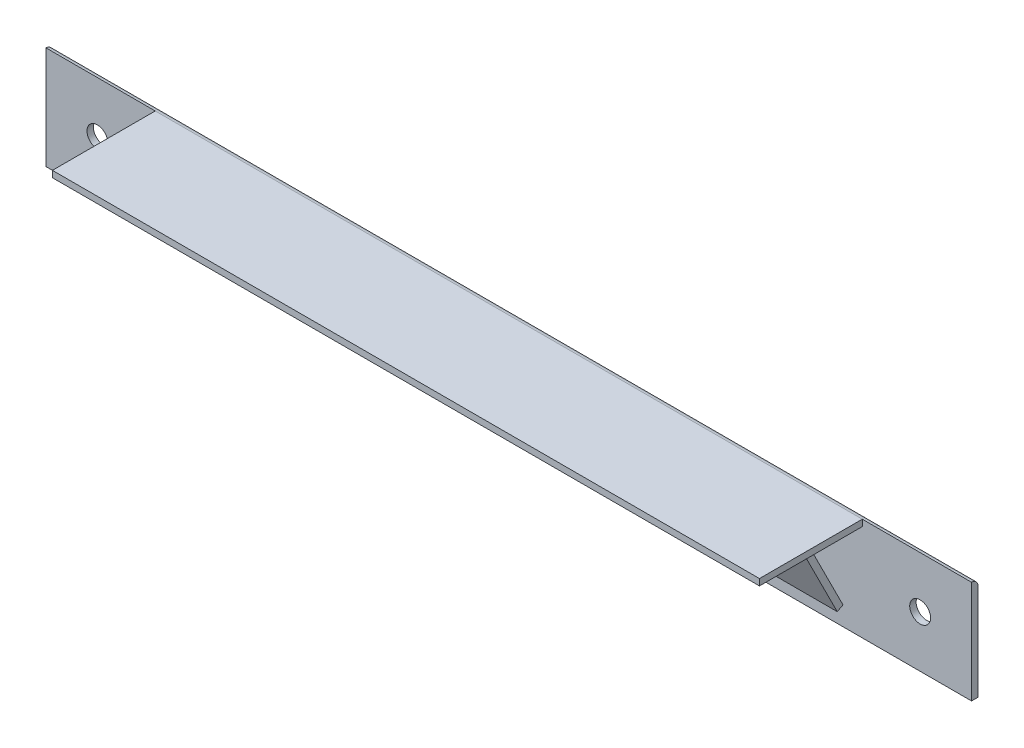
from build123d import *

# Parameters (mm, degrees)
SKETCH1_W          = 914.4
SKETCH1_H          = 101.6
EXTRUDE1_DEPTH     = 6.35
SKETCH2_R          = 10.31875
CUT_EXTRUDE1_DEPTH = 6.35
SKETCH3_R          = 10.31875
CUT_EXTRUDE2_DEPTH = 6.35
SKETCH4_W          = 698.5
SKETCH4_H          = 6.35
EXTRUDE2_DEPTH     = 101.6
FILLET1_R          = 6.35
EXTRUDE3_DEPTH     = 787.4
CUT_EXTRUDE3_DEPTH = 127


with BuildPart() as part:
    # Sketch1 → Extrude1 (new body)
    with BuildSketch(Plane.XY):
        with Locations((-457.2, -50.8)):
            Rectangle(SKETCH1_W, SKETCH1_H)
    extrude(amount=EXTRUDE1_DEPTH)

    # Sketch2 → Cut-Extrude1 (cut)
    with BuildSketch(Plane.XY.offset(6.35)):
        with Locations((-863.6, -50.8)):
            Circle(SKETCH2_R)
    extrude(amount=-CUT_EXTRUDE1_DEPTH, mode=Mode.SUBTRACT)

    # Sketch3 → Cut-Extrude2 (cut)
    with BuildSketch(Plane.XY.offset(6.35)):
        with Locations((-50.8, -50.8)):
            Circle(SKETCH3_R)
    extrude(amount=-CUT_EXTRUDE2_DEPTH, mode=Mode.SUBTRACT)

    # Sketch4 → Extrude2 (add)
    with BuildSketch(Plane.XY.offset(6.35)):
        with Locations((-457.2, -3.175)):
            Rectangle(SKETCH4_W, SKETCH4_H)
    extrude(amount=EXTRUDE2_DEPTH)

    # Fillet1
    fillet1_edges = [part.edges().sort_by_distance(p)[0] for p in [
        (-457.2, 0, 0),
    ]]
    fillet(fillet1_edges, radius=FILLET1_R)


with BuildPart() as body_2:
    # Sketch5 → Extrude3 (new body)
    with BuildSketch(Plane(origin=(0, 0, 0), x_dir=(0, 0, -1), z_dir=(1, 0, 0))):
        Polygon((-44.785418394, -6.35), (-6.35, -82.906715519), (-12.073833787, -85.780375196), (-50.509252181, -9.223659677), align=None)
    extrude(amount=-EXTRUDE3_DEPTH)

    # Sketch5_2 → Cut-Extrude3 (cut)
    with BuildSketch(Plane(origin=(0, 0, 0), x_dir=(0, 0, -1), z_dir=(1, 0, 0))):
        Polygon((-44.785418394, -6.35), (-6.35, -82.906715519), (-12.073833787, -85.780375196), (-50.509252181, -9.223659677), align=None)
    extrude(amount=-CUT_EXTRUDE3_DEPTH, mode=Mode.SUBTRACT)


solid = Compound([part.part, body_2.part])
